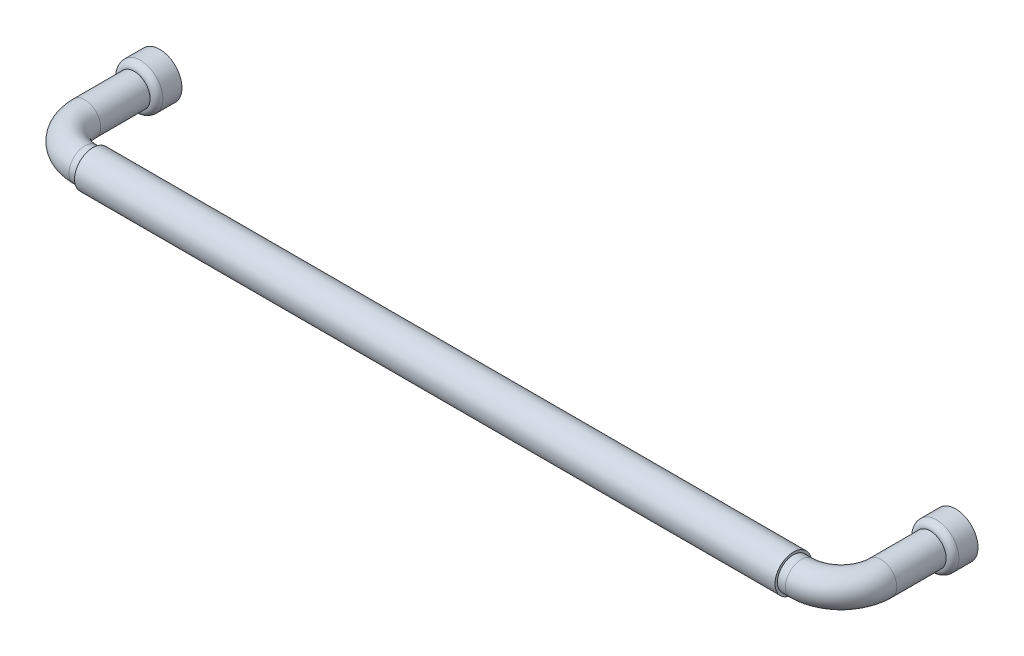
ISO-10303-21;
HEADER;
FILE_DESCRIPTION(('STEP AP214'),'2;1');
FILE_NAME('part.step','',(''),(''),'','','');
FILE_SCHEMA(('AUTOMOTIVE_DESIGN { 1 0 10303 214 1 1 1 1 }'));
ENDSEC;
DATA;
#1=APPLICATION_CONTEXT('core data for automotive mechanical design processes');
#2=APPLICATION_PROTOCOL_DEFINITION('international standard','automotive_design',2000,#1);
#3=PRODUCT_CONTEXT('',#1,'mechanical');
#4=PRODUCT('Part','Part','',(#3));
#5=PRODUCT_RELATED_PRODUCT_CATEGORY('part','',(#4));
#6=PRODUCT_DEFINITION_FORMATION('','',#4);
#7=PRODUCT_DEFINITION_CONTEXT('part definition',#1,'design');
#8=PRODUCT_DEFINITION('design','',#6,#7);
#9=PRODUCT_DEFINITION_SHAPE('','',#8);
#10=(LENGTH_UNIT() NAMED_UNIT(*) SI_UNIT(.MILLI.,.METRE.));
#11=(NAMED_UNIT(*) PLANE_ANGLE_UNIT() SI_UNIT($,.RADIAN.));
#12=(NAMED_UNIT(*) SI_UNIT($,.STERADIAN.) SOLID_ANGLE_UNIT());
#13=UNCERTAINTY_MEASURE_WITH_UNIT(LENGTH_MEASURE(1.E-05),#10,'distance_accuracy_value','');
#14=(GEOMETRIC_REPRESENTATION_CONTEXT(3) GLOBAL_UNCERTAINTY_ASSIGNED_CONTEXT((#13)) GLOBAL_UNIT_ASSIGNED_CONTEXT((#10,
#11,#12)) REPRESENTATION_CONTEXT('',''));
#15=CARTESIAN_POINT('',(0.,0.,0.));
#16=DIRECTION('',(0.,0.,1.));
#17=DIRECTION('',(1.,0.,0.));
#18=AXIS2_PLACEMENT_3D('',#15,#16,#17);
#19=CARTESIAN_POINT('',(0.,0.,0.));
#20=DIRECTION('',(0.,0.,-1.));
#21=DIRECTION('',(0.,1.,0.));
#22=AXIS2_PLACEMENT_3D('',#19,#20,#21);
#23=PLANE('',#22);
#24=CARTESIAN_POINT('',(0.,0.,0.));
#25=DIRECTION('',(0.,0.,1.));
#26=DIRECTION('',(0.,-1.,0.));
#27=AXIS2_PLACEMENT_3D('',#24,#25,#26);
#28=CIRCLE('',#27,7.00045758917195);
#29=CARTESIAN_POINT('',(0.,-7.00045758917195,0.));
#30=VERTEX_POINT('',#29);
#31=EDGE_CURVE('E295',#30,#30,#28,.T.);
#32=ORIENTED_EDGE('',*,*,#31,.F.);
#33=EDGE_LOOP('',(#32));
#34=FACE_BOUND('',#33,.T.);
#35=CARTESIAN_POINT('',(0.,0.,0.));
#36=DIRECTION('',(0.,0.,1.));
#37=DIRECTION('',(0.,-1.,0.));
#38=AXIS2_PLACEMENT_3D('',#35,#36,#37);
#39=CIRCLE('',#38,2.5);
#40=CARTESIAN_POINT('',(0.,-2.5,0.));
#41=VERTEX_POINT('',#40);
#42=EDGE_CURVE('E285',#41,#41,#39,.T.);
#43=ORIENTED_EDGE('',*,*,#42,.T.);
#44=EDGE_LOOP('',(#43));
#45=FACE_BOUND('',#44,.T.);
#46=ADVANCED_FACE('F12',(#34,#45),#23,.T.);
#47=CARTESIAN_POINT('',(237.5,0.,36.));
#48=DIRECTION('',(-1.,0.,0.));
#49=DIRECTION('',(0.,-1.,0.));
#50=AXIS2_PLACEMENT_3D('',#47,#48,#49);
#51=CYLINDRICAL_SURFACE('',#50,5.);
#52=CARTESIAN_POINT('',(235.,0.,36.));
#53=DIRECTION('',(1.,0.,0.));
#54=DIRECTION('',(0.,1.,0.));
#55=AXIS2_PLACEMENT_3D('',#52,#53,#54);
#56=CIRCLE('',#55,5.);
#57=CARTESIAN_POINT('',(235.,5.,36.));
#58=VERTEX_POINT('',#57);
#59=EDGE_CURVE('E19',#58,#58,#56,.F.);
#60=ORIENTED_EDGE('',*,*,#59,.F.);
#61=EDGE_LOOP('',(#60));
#62=FACE_BOUND('',#61,.T.);
#63=CARTESIAN_POINT('',(237.5,0.,36.));
#64=DIRECTION('',(-1.,0.,0.));
#65=DIRECTION('',(0.,1.,0.));
#66=AXIS2_PLACEMENT_3D('',#63,#64,#65);
#67=CIRCLE('',#66,5.);
#68=CARTESIAN_POINT('',(237.5,0.,41.0000000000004));
#69=VERTEX_POINT('',#68);
#70=EDGE_CURVE('E55',#69,#69,#67,.T.);
#71=ORIENTED_EDGE('',*,*,#70,.T.);
#72=EDGE_LOOP('',(#71));
#73=FACE_BOUND('',#72,.T.);
#74=ADVANCED_FACE('F77',(#62,#73),#51,.T.);
#75=CARTESIAN_POINT('',(237.5,0.,23.5000000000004));
#76=DIRECTION('',(0.,-1.,0.));
#77=DIRECTION('',(1.,0.,0.));
#78=AXIS2_PLACEMENT_3D('',#75,#76,#77);
#79=TOROIDAL_SURFACE('',#78,12.5,5.);
#80=CARTESIAN_POINT('',(250.,0.,23.5000000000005));
#81=DIRECTION('',(0.,0.,1.));
#82=DIRECTION('',(0.,1.,0.));
#83=AXIS2_PLACEMENT_3D('',#80,#81,#82);
#84=CIRCLE('',#83,5.);
#85=CARTESIAN_POINT('',(255.,0.,23.5000000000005));
#86=VERTEX_POINT('',#85);
#87=EDGE_CURVE('E52',#86,#86,#84,.T.);
#88=CARTESIAN_POINT('',(237.5,0.,23.5000000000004));
#89=DIRECTION('',(0.,-1.,0.));
#90=DIRECTION('',(1.,0.,0.));
#91=AXIS2_PLACEMENT_3D('',#88,#89,#90);
#92=CIRCLE('',#91,17.5);
#93=EDGE_CURVE('',#86,#69,#92,.T.);
#94=ORIENTED_EDGE('',*,*,#87,.T.);
#95=ORIENTED_EDGE('',*,*,#70,.F.);
#96=ORIENTED_EDGE('',*,*,#93,.T.);
#97=ORIENTED_EDGE('',*,*,#93,.F.);
#98=EDGE_LOOP('',(#94,#96,#95,#97));
#99=FACE_BOUND('',#98,.T.);
#100=ADVANCED_FACE('F87',(#99),#79,.T.);
#101=CARTESIAN_POINT('',(250.,0.,23.5000000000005));
#102=DIRECTION('',(0.,0.,-1.));
#103=DIRECTION('',(0.,-1.,0.));
#104=AXIS2_PLACEMENT_3D('',#101,#102,#103);
#105=CYLINDRICAL_SURFACE('',#104,5.);
#106=CARTESIAN_POINT('',(250.,0.,7.9992113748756));
#107=DIRECTION('',(0.,0.,1.));
#108=DIRECTION('',(0.,1.,0.));
#109=AXIS2_PLACEMENT_3D('',#106,#107,#108);
#110=CIRCLE('',#109,5.);
#111=CARTESIAN_POINT('',(250.,5.,7.9992113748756));
#112=VERTEX_POINT('',#111);
#113=EDGE_CURVE('E31',#112,#112,#110,.T.);
#114=ORIENTED_EDGE('',*,*,#113,.T.);
#115=EDGE_LOOP('',(#114));
#116=FACE_BOUND('',#115,.T.);
#117=ORIENTED_EDGE('',*,*,#87,.F.);
#118=EDGE_LOOP('',(#117));
#119=FACE_BOUND('',#118,.T.);
#120=ADVANCED_FACE('F95',(#116,#119),#105,.T.);
#121=CARTESIAN_POINT('',(235.,0.,36.));
#122=DIRECTION('',(1.,0.,0.));
#123=DIRECTION('',(0.,1.,0.));
#124=AXIS2_PLACEMENT_3D('',#121,#122,#123);
#125=PLANE('',#124);
#126=ORIENTED_EDGE('',*,*,#59,.T.);
#127=EDGE_LOOP('',(#126));
#128=FACE_BOUND('',#127,.T.);
#129=CARTESIAN_POINT('',(235.,0.,36.));
#130=DIRECTION('',(1.,0.,0.));
#131=DIRECTION('',(0.,1.,0.));
#132=AXIS2_PLACEMENT_3D('',#129,#130,#131);
#133=CIRCLE('',#132,5.75);
#134=CARTESIAN_POINT('',(235.,5.75,36.));
#135=VERTEX_POINT('',#134);
#136=EDGE_CURVE('E38',#135,#135,#133,.T.);
#137=ORIENTED_EDGE('',*,*,#136,.T.);
#138=EDGE_LOOP('',(#137));
#139=FACE_BOUND('',#138,.T.);
#140=ADVANCED_FACE('F98',(#128,#139),#125,.T.);
#141=CARTESIAN_POINT('',(140.885269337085,0.,36.));
#142=DIRECTION('',(1.,0.,0.));
#143=DIRECTION('',(0.,1.,0.));
#144=AXIS2_PLACEMENT_3D('',#141,#142,#143);
#145=CYLINDRICAL_SURFACE('',#144,5.75);
#146=ORIENTED_EDGE('',*,*,#136,.F.);
#147=EDGE_LOOP('',(#146));
#148=FACE_BOUND('',#147,.T.);
#149=CARTESIAN_POINT('',(15.,0.,36.));
#150=DIRECTION('',(1.,0.,0.));
#151=DIRECTION('',(0.,1.,0.));
#152=AXIS2_PLACEMENT_3D('',#149,#150,#151);
#153=CIRCLE('',#152,5.75);
#154=CARTESIAN_POINT('',(15.,5.75,36.));
#155=VERTEX_POINT('',#154);
#156=EDGE_CURVE('E33',#155,#155,#153,.T.);
#157=ORIENTED_EDGE('',*,*,#156,.T.);
#158=EDGE_LOOP('',(#157));
#159=FACE_BOUND('',#158,.T.);
#160=ADVANCED_FACE('F127',(#148,#159),#145,.T.);
#161=CARTESIAN_POINT('',(15.,0.,41.75));
#162=DIRECTION('',(-1.,0.,0.));
#163=DIRECTION('',(0.,-1.,0.));
#164=AXIS2_PLACEMENT_3D('',#161,#162,#163);
#165=PLANE('',#164);
#166=CARTESIAN_POINT('',(15.,0.,36.));
#167=DIRECTION('',(-1.,0.,0.));
#168=DIRECTION('',(0.,-1.,0.));
#169=AXIS2_PLACEMENT_3D('',#166,#167,#168);
#170=CIRCLE('',#169,5.);
#171=CARTESIAN_POINT('',(15.,-5.,36.));
#172=VERTEX_POINT('',#171);
#173=EDGE_CURVE('E23',#172,#172,#170,.F.);
#174=ORIENTED_EDGE('',*,*,#173,.T.);
#175=EDGE_LOOP('',(#174));
#176=FACE_BOUND('',#175,.T.);
#177=ORIENTED_EDGE('',*,*,#156,.F.);
#178=EDGE_LOOP('',(#177));
#179=FACE_BOUND('',#178,.T.);
#180=ADVANCED_FACE('F78',(#176,#179),#165,.T.);
#181=CARTESIAN_POINT('',(0.,0.,23.5));
#182=DIRECTION('',(0.,0.,-1.));
#183=DIRECTION('',(-1.,0.,0.));
#184=AXIS2_PLACEMENT_3D('',#181,#182,#183);
#185=CYLINDRICAL_SURFACE('',#184,5.);
#186=CARTESIAN_POINT('',(0.,0.,7.99921137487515));
#187=DIRECTION('',(0.,0.,1.));
#188=DIRECTION('',(0.,1.,0.));
#189=AXIS2_PLACEMENT_3D('',#186,#187,#188);
#190=CIRCLE('',#189,5.);
#191=CARTESIAN_POINT('',(0.,5.,7.99921137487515));
#192=VERTEX_POINT('',#191);
#193=EDGE_CURVE('E8',#192,#192,#190,.F.);
#194=ORIENTED_EDGE('',*,*,#193,.F.);
#195=EDGE_LOOP('',(#194));
#196=FACE_BOUND('',#195,.T.);
#197=CARTESIAN_POINT('',(0.,0.,23.5));
#198=DIRECTION('',(0.,0.,-1.));
#199=DIRECTION('',(0.,1.,0.));
#200=AXIS2_PLACEMENT_3D('',#197,#198,#199);
#201=CIRCLE('',#200,5.);
#202=CARTESIAN_POINT('',(-5.,0.,23.5));
#203=VERTEX_POINT('',#202);
#204=EDGE_CURVE('E28',#203,#203,#201,.T.);
#205=ORIENTED_EDGE('',*,*,#204,.T.);
#206=EDGE_LOOP('',(#205));
#207=FACE_BOUND('',#206,.T.);
#208=ADVANCED_FACE('F14',(#196,#207),#185,.T.);
#209=CARTESIAN_POINT('',(12.5,0.,23.5));
#210=DIRECTION('',(0.,-1.,0.));
#211=DIRECTION('',(1.,0.,0.));
#212=AXIS2_PLACEMENT_3D('',#209,#210,#211);
#213=TOROIDAL_SURFACE('',#212,12.5,5.);
#214=CARTESIAN_POINT('',(12.5,0.,36.));
#215=DIRECTION('',(-1.,0.,0.));
#216=DIRECTION('',(0.,1.,0.));
#217=AXIS2_PLACEMENT_3D('',#214,#215,#216);
#218=CIRCLE('',#217,5.);
#219=CARTESIAN_POINT('',(12.5,0.,41.));
#220=VERTEX_POINT('',#219);
#221=EDGE_CURVE('E58',#220,#220,#218,.T.);
#222=CARTESIAN_POINT('',(12.5,0.,23.5));
#223=DIRECTION('',(0.,-1.,0.));
#224=DIRECTION('',(1.,0.,0.));
#225=AXIS2_PLACEMENT_3D('',#222,#223,#224);
#226=CIRCLE('',#225,17.5);
#227=EDGE_CURVE('',#220,#203,#226,.T.);
#228=ORIENTED_EDGE('',*,*,#221,.T.);
#229=ORIENTED_EDGE('',*,*,#204,.F.);
#230=ORIENTED_EDGE('',*,*,#227,.T.);
#231=ORIENTED_EDGE('',*,*,#227,.F.);
#232=EDGE_LOOP('',(#228,#230,#229,#231));
#233=FACE_BOUND('',#232,.T.);
#234=ADVANCED_FACE('F64',(#233),#213,.T.);
#235=ORIENTED_EDGE('',*,*,#173,.F.);
#236=EDGE_LOOP('',(#235));
#237=FACE_BOUND('',#236,.T.);
#238=ORIENTED_EDGE('',*,*,#221,.F.);
#239=EDGE_LOOP('',(#238));
#240=FACE_BOUND('',#239,.T.);
#241=ADVANCED_FACE('F66',(#237,#240),#51,.T.);
#242=CARTESIAN_POINT('',(244.999542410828,0.,7.99921137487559));
#243=DIRECTION('',(0.,0.,1.));
#244=DIRECTION('',(0.,1.,0.));
#245=AXIS2_PLACEMENT_3D('',#242,#243,#244);
#246=PLANE('',#245);
#247=CARTESIAN_POINT('',(250.,0.,7.9992113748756));
#248=DIRECTION('',(0.,0.,-1.));
#249=DIRECTION('',(0.,-1.,0.));
#250=AXIS2_PLACEMENT_3D('',#247,#248,#249);
#251=CIRCLE('',#250,5.00045758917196);
#252=CARTESIAN_POINT('',(250.,-5.00045758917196,7.9992113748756));
#253=VERTEX_POINT('',#252);
#254=EDGE_CURVE('E46',#253,#253,#251,.T.);
#255=ORIENTED_EDGE('',*,*,#254,.F.);
#256=EDGE_LOOP('',(#255));
#257=FACE_BOUND('',#256,.T.);
#258=ORIENTED_EDGE('',*,*,#113,.F.);
#259=EDGE_LOOP('',(#258));
#260=FACE_BOUND('',#259,.T.);
#261=ADVANCED_FACE('F74',(#257,#260),#246,.T.);
#262=CARTESIAN_POINT('',(250.,0.,4.3234021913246E-13));
#263=DIRECTION('',(0.,0.,-1.));
#264=DIRECTION('',(0.,-1.,0.));
#265=AXIS2_PLACEMENT_3D('',#262,#263,#264);
#266=CYLINDRICAL_SURFACE('',#265,7.00045758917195);
#267=CARTESIAN_POINT('',(250.,0.,5.9992113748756));
#268=DIRECTION('',(0.,0.,-1.));
#269=DIRECTION('',(0.,-1.,0.));
#270=AXIS2_PLACEMENT_3D('',#267,#268,#269);
#271=CIRCLE('',#270,7.00045758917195);
#272=CARTESIAN_POINT('',(250.,-7.00045758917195,5.9992113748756));
#273=VERTEX_POINT('',#272);
#274=EDGE_CURVE('E41',#273,#273,#271,.T.);
#275=ORIENTED_EDGE('',*,*,#274,.T.);
#276=EDGE_LOOP('',(#275));
#277=FACE_BOUND('',#276,.T.);
#278=CARTESIAN_POINT('',(250.,0.,4.3234021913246E-13));
#279=DIRECTION('',(0.,0.,-1.));
#280=DIRECTION('',(0.,-1.,0.));
#281=AXIS2_PLACEMENT_3D('',#278,#279,#280);
#282=CIRCLE('',#281,7.00045758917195);
#283=CARTESIAN_POINT('',(250.,-7.00045758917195,4.3234021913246E-13));
#284=VERTEX_POINT('',#283);
#285=EDGE_CURVE('E34',#284,#284,#282,.T.);
#286=ORIENTED_EDGE('',*,*,#285,.F.);
#287=EDGE_LOOP('',(#286));
#288=FACE_BOUND('',#287,.T.);
#289=ADVANCED_FACE('F181',(#277,#288),#266,.T.);
#290=CARTESIAN_POINT('',(250.,0.,5.9992113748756));
#291=DIRECTION('',(0.,0.,-1.));
#292=DIRECTION('',(0.,-1.,0.));
#293=AXIS2_PLACEMENT_3D('',#290,#291,#292);
#294=TOROIDAL_SURFACE('',#293,5.00045758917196,2.);
#295=ORIENTED_EDGE('',*,*,#254,.T.);
#296=EDGE_LOOP('',(#295));
#297=FACE_BOUND('',#296,.T.);
#298=ORIENTED_EDGE('',*,*,#274,.F.);
#299=EDGE_LOOP('',(#298));
#300=FACE_BOUND('',#299,.T.);
#301=ADVANCED_FACE('F189',(#297,#300),#294,.T.);
#302=CARTESIAN_POINT('',(250.,0.,4.3234021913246E-13));
#303=DIRECTION('',(0.,0.,1.));
#304=DIRECTION('',(0.,1.,0.));
#305=AXIS2_PLACEMENT_3D('',#302,#303,#304);
#306=PLANE('',#305);
#307=CARTESIAN_POINT('',(250.,0.,4.3234021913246E-13));
#308=DIRECTION('',(0.,0.,-1.));
#309=DIRECTION('',(0.,-1.,0.));
#310=AXIS2_PLACEMENT_3D('',#307,#308,#309);
#311=CIRCLE('',#310,2.5);
#312=CARTESIAN_POINT('',(250.,-2.5,4.3234021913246E-13));
#313=VERTEX_POINT('',#312);
#314=EDGE_CURVE('E298',#313,#313,#311,.T.);
#315=ORIENTED_EDGE('',*,*,#314,.F.);
#316=EDGE_LOOP('',(#315));
#317=FACE_BOUND('',#316,.T.);
#318=ORIENTED_EDGE('',*,*,#285,.T.);
#319=EDGE_LOOP('',(#318));
#320=FACE_BOUND('',#319,.T.);
#321=ADVANCED_FACE('F93',(#317,#320),#306,.F.);
#322=CARTESIAN_POINT('',(250.,0.,11.0000000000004));
#323=DIRECTION('',(0.,0.,-1.));
#324=DIRECTION('',(0.,-1.,0.));
#325=AXIS2_PLACEMENT_3D('',#322,#323,#324);
#326=CYLINDRICAL_SURFACE('',#325,2.5);
#327=CARTESIAN_POINT('',(250.,0.,11.0000000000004));
#328=DIRECTION('',(0.,0.,-1.));
#329=DIRECTION('',(0.,-1.,0.));
#330=AXIS2_PLACEMENT_3D('',#327,#328,#329);
#331=CIRCLE('',#330,2.5);
#332=CARTESIAN_POINT('',(250.,-2.5,11.0000000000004));
#333=VERTEX_POINT('',#332);
#334=EDGE_CURVE('E301',#333,#333,#331,.T.);
#335=ORIENTED_EDGE('',*,*,#334,.F.);
#336=EDGE_LOOP('',(#335));
#337=FACE_BOUND('',#336,.T.);
#338=ORIENTED_EDGE('',*,*,#314,.T.);
#339=EDGE_LOOP('',(#338));
#340=FACE_BOUND('',#339,.T.);
#341=ADVANCED_FACE('F206',(#337,#340),#326,.F.);
#342=CARTESIAN_POINT('',(250.,0.,11.0000000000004));
#343=DIRECTION('',(0.,0.,-1.));
#344=DIRECTION('',(0.,-1.,0.));
#345=AXIS2_PLACEMENT_3D('',#342,#343,#344);
#346=PLANE('',#345);
#347=ORIENTED_EDGE('',*,*,#334,.T.);
#348=EDGE_LOOP('',(#347));
#349=FACE_BOUND('',#348,.T.);
#350=ADVANCED_FACE('F208',(#349),#346,.T.);
#351=CARTESIAN_POINT('',(0.,0.,0.));
#352=DIRECTION('',(0.,0.,-1.));
#353=DIRECTION('',(0.,-1.,0.));
#354=AXIS2_PLACEMENT_3D('',#351,#352,#353);
#355=CYLINDRICAL_SURFACE('',#354,7.00045758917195);
#356=CARTESIAN_POINT('',(0.,0.,5.99921137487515));
#357=DIRECTION('',(0.,0.,1.));
#358=DIRECTION('',(0.,-1.,0.));
#359=AXIS2_PLACEMENT_3D('',#356,#357,#358);
#360=CIRCLE('',#359,7.00045758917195);
#361=CARTESIAN_POINT('',(0.,-7.00045758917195,5.99921137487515));
#362=VERTEX_POINT('',#361);
#363=EDGE_CURVE('E288',#362,#362,#360,.T.);
#364=ORIENTED_EDGE('',*,*,#363,.F.);
#365=EDGE_LOOP('',(#364));
#366=FACE_BOUND('',#365,.T.);
#367=ORIENTED_EDGE('',*,*,#31,.T.);
#368=EDGE_LOOP('',(#367));
#369=FACE_BOUND('',#368,.T.);
#370=ADVANCED_FACE('F217',(#366,#369),#355,.T.);
#371=CARTESIAN_POINT('',(0.,0.,5.99921137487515));
#372=DIRECTION('',(0.,0.,-1.));
#373=DIRECTION('',(0.,-1.,0.));
#374=AXIS2_PLACEMENT_3D('',#371,#372,#373);
#375=TOROIDAL_SURFACE('',#374,5.00045758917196,2.);
#376=CARTESIAN_POINT('',(0.,0.,7.99921137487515));
#377=DIRECTION('',(0.,0.,1.));
#378=DIRECTION('',(0.,-1.,0.));
#379=AXIS2_PLACEMENT_3D('',#376,#377,#378);
#380=CIRCLE('',#379,5.00045758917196);
#381=CARTESIAN_POINT('',(0.,-5.00045758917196,7.99921137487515));
#382=VERTEX_POINT('',#381);
#383=EDGE_CURVE('E284',#382,#382,#380,.T.);
#384=ORIENTED_EDGE('',*,*,#383,.F.);
#385=EDGE_LOOP('',(#384));
#386=FACE_BOUND('',#385,.T.);
#387=ORIENTED_EDGE('',*,*,#363,.T.);
#388=EDGE_LOOP('',(#387));
#389=FACE_BOUND('',#388,.T.);
#390=ADVANCED_FACE('F232',(#386,#389),#375,.T.);
#391=CARTESIAN_POINT('',(5.00045758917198,0.,7.99921137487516));
#392=DIRECTION('',(0.,0.,1.));
#393=DIRECTION('',(0.,1.,0.));
#394=AXIS2_PLACEMENT_3D('',#391,#392,#393);
#395=PLANE('',#394);
#396=ORIENTED_EDGE('',*,*,#193,.T.);
#397=EDGE_LOOP('',(#396));
#398=FACE_BOUND('',#397,.T.);
#399=ORIENTED_EDGE('',*,*,#383,.T.);
#400=EDGE_LOOP('',(#399));
#401=FACE_BOUND('',#400,.T.);
#402=ADVANCED_FACE('F241',(#398,#401),#395,.T.);
#403=CARTESIAN_POINT('',(0.,0.,11.));
#404=DIRECTION('',(0.,0.,-1.));
#405=DIRECTION('',(0.,-1.,0.));
#406=AXIS2_PLACEMENT_3D('',#403,#404,#405);
#407=CYLINDRICAL_SURFACE('',#406,2.5);
#408=CARTESIAN_POINT('',(0.,0.,11.));
#409=DIRECTION('',(0.,0.,1.));
#410=DIRECTION('',(0.,-1.,0.));
#411=AXIS2_PLACEMENT_3D('',#408,#409,#410);
#412=CIRCLE('',#411,2.5);
#413=CARTESIAN_POINT('',(0.,-2.5,11.));
#414=VERTEX_POINT('',#413);
#415=EDGE_CURVE('E283',#414,#414,#412,.T.);
#416=ORIENTED_EDGE('',*,*,#415,.T.);
#417=EDGE_LOOP('',(#416));
#418=FACE_BOUND('',#417,.T.);
#419=ORIENTED_EDGE('',*,*,#42,.F.);
#420=EDGE_LOOP('',(#419));
#421=FACE_BOUND('',#420,.T.);
#422=ADVANCED_FACE('F250',(#418,#421),#407,.F.);
#423=CARTESIAN_POINT('',(0.,0.,11.));
#424=DIRECTION('',(0.,0.,-1.));
#425=DIRECTION('',(0.,-1.,0.));
#426=AXIS2_PLACEMENT_3D('',#423,#424,#425);
#427=PLANE('',#426);
#428=ORIENTED_EDGE('',*,*,#415,.F.);
#429=EDGE_LOOP('',(#428));
#430=FACE_BOUND('',#429,.T.);
#431=ADVANCED_FACE('F252',(#430),#427,.T.);
#432=CLOSED_SHELL('',(#46,#74,#100,#120,#140,#160,#180,#208,#234,#241,#261,#289,#301,#321,#341,
#350,#370,#390,#402,#422,#431));
#433=MANIFOLD_SOLID_BREP('B1',#432);
#434=ADVANCED_BREP_SHAPE_REPRESENTATION('',(#18,#433),#14);
#435=SHAPE_DEFINITION_REPRESENTATION(#9,#434);
ENDSEC;
END-ISO-10303-21;
